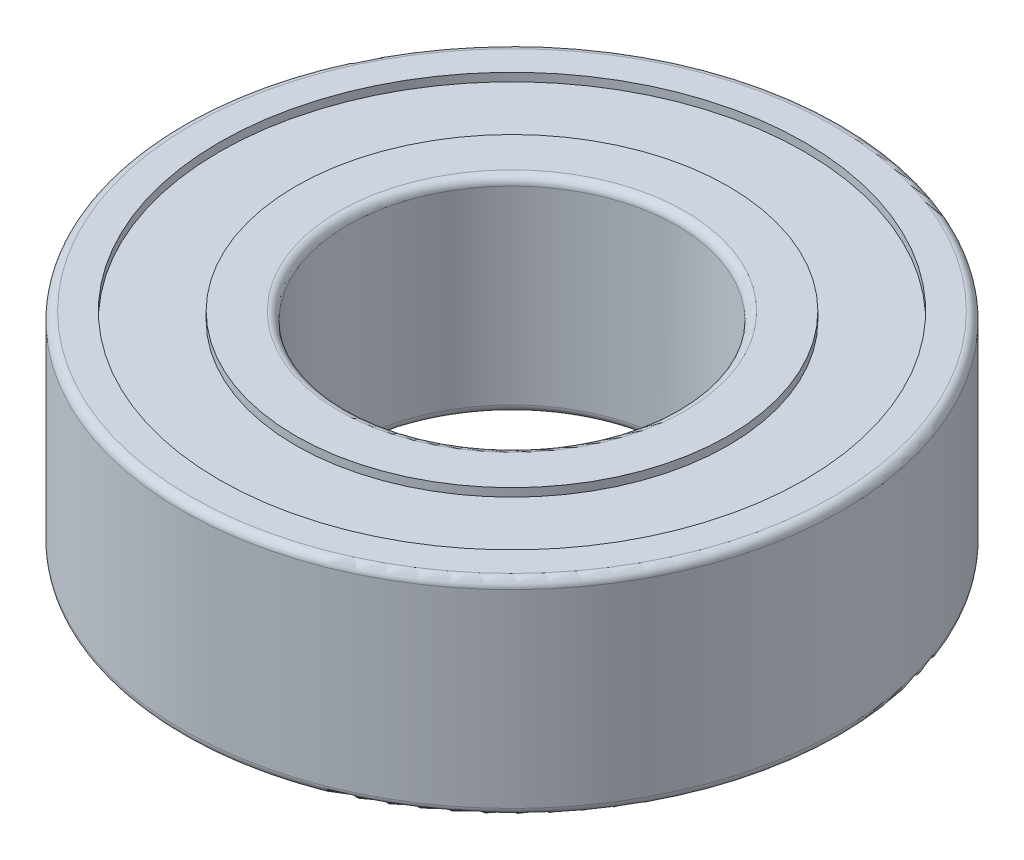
ISO-10303-21;
HEADER;
FILE_DESCRIPTION(('STEP AP214'),'2;1');
FILE_NAME('part.step','',(''),(''),'','','');
FILE_SCHEMA(('AUTOMOTIVE_DESIGN { 1 0 10303 214 1 1 1 1 }'));
ENDSEC;
DATA;
#1=APPLICATION_CONTEXT('core data for automotive mechanical design processes');
#2=APPLICATION_PROTOCOL_DEFINITION('international standard','automotive_design',2000,#1);
#3=PRODUCT_CONTEXT('',#1,'mechanical');
#4=PRODUCT('Part','Part','',(#3));
#5=PRODUCT_RELATED_PRODUCT_CATEGORY('part','',(#4));
#6=PRODUCT_DEFINITION_FORMATION('','',#4);
#7=PRODUCT_DEFINITION_CONTEXT('part definition',#1,'design');
#8=PRODUCT_DEFINITION('design','',#6,#7);
#9=PRODUCT_DEFINITION_SHAPE('','',#8);
#10=(LENGTH_UNIT() NAMED_UNIT(*) SI_UNIT(.MILLI.,.METRE.));
#11=(NAMED_UNIT(*) PLANE_ANGLE_UNIT() SI_UNIT($,.RADIAN.));
#12=(NAMED_UNIT(*) SI_UNIT($,.STERADIAN.) SOLID_ANGLE_UNIT());
#13=UNCERTAINTY_MEASURE_WITH_UNIT(LENGTH_MEASURE(1.E-05),#10,'distance_accuracy_value','');
#14=(GEOMETRIC_REPRESENTATION_CONTEXT(3) GLOBAL_UNCERTAINTY_ASSIGNED_CONTEXT((#13)) GLOBAL_UNIT_ASSIGNED_CONTEXT((#10,
#11,#12)) REPRESENTATION_CONTEXT('',''));
#15=CARTESIAN_POINT('',(0.,0.,0.));
#16=DIRECTION('',(0.,0.,1.));
#17=DIRECTION('',(1.,0.,0.));
#18=AXIS2_PLACEMENT_3D('',#15,#16,#17);
#19=CARTESIAN_POINT('',(0.,2.75,0.));
#20=DIRECTION('',(0.,-1.,0.));
#21=DIRECTION('',(0.,0.,-1.));
#22=AXIS2_PLACEMENT_3D('',#19,#20,#21);
#23=CYLINDRICAL_SURFACE('',#22,4.);
#24=CARTESIAN_POINT('',(0.,2.3,0.));
#25=DIRECTION('',(0.,-1.,0.));
#26=DIRECTION('',(0.999963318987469,0.,0.00856508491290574));
#27=AXIS2_PLACEMENT_3D('',#24,#25,#26);
#28=CIRCLE('',#27,4.);
#29=CARTESIAN_POINT('',(3.99985327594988,2.3,0.034260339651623));
#30=VERTEX_POINT('',#29);
#31=EDGE_CURVE('E258',#30,#30,#28,.T.);
#32=ORIENTED_EDGE('',*,*,#31,.F.);
#33=EDGE_LOOP('',(#32));
#34=FACE_BOUND('',#33,.T.);
#35=CARTESIAN_POINT('',(0.,-2.3,0.));
#36=DIRECTION('',(0.,-1.,0.));
#37=DIRECTION('',(-0.999919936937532,0.,-0.0126538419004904));
#38=AXIS2_PLACEMENT_3D('',#35,#36,#37);
#39=CIRCLE('',#38,4.);
#40=CARTESIAN_POINT('',(-3.99967974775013,-2.3,-0.0506153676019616));
#41=VERTEX_POINT('',#40);
#42=EDGE_CURVE('E74',#41,#41,#39,.F.);
#43=ORIENTED_EDGE('',*,*,#42,.F.);
#44=EDGE_LOOP('',(#43));
#45=FACE_BOUND('',#44,.T.);
#46=ADVANCED_FACE('F17',(#34,#45),#23,.F.);
#47=CARTESIAN_POINT('',(0.,2.3,0.));
#48=DIRECTION('',(0.,-1.,0.));
#49=DIRECTION('',(0.999963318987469,0.,0.00856508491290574));
#50=AXIS2_PLACEMENT_3D('',#47,#48,#49);
#51=TOROIDAL_SURFACE('',#50,4.2,0.2);
#52=CARTESIAN_POINT('',(-4.199999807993,2.49999999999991,0.));
#53=CARTESIAN_POINT('',(-4.19998514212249,2.49999999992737,0.0623584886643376));
#54=CARTESIAN_POINT('',(-4.19858069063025,2.49999999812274,0.124716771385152));
#55=CARTESIAN_POINT('',(-4.1928852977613,2.49999999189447,0.251851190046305));
#56=CARTESIAN_POINT('',(-4.18847892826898,2.49999998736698,0.316622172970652));
#57=CARTESIAN_POINT('',(-4.17643909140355,2.49999997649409,0.448424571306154));
#58=CARTESIAN_POINT('',(-4.16868589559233,2.49999997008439,0.515445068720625));
#59=CARTESIAN_POINT('',(-4.14960926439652,2.49999995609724,0.651555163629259));
#60=CARTESIAN_POINT('',(-4.13816219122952,2.49999994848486,0.720627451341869));
#61=CARTESIAN_POINT('',(-4.11135324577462,2.49999993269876,0.860613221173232));
#62=CARTESIAN_POINT('',(-4.09586420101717,2.49999992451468,0.931502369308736));
#63=CARTESIAN_POINT('',(-4.0606295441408,2.49999990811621,1.0748547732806));
#64=CARTESIAN_POINT('',(-4.04075369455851,2.49999989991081,1.14728603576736));
#65=CARTESIAN_POINT('',(-3.99640998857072,2.49999988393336,1.29341476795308));
#66=CARTESIAN_POINT('',(-3.97180935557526,2.49999987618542,1.36707198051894));
#67=CARTESIAN_POINT('',(-3.91769289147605,2.49999986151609,1.5152994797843));
#68=CARTESIAN_POINT('',(-3.88804239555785,2.49999985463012,1.5898205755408));
#69=CARTESIAN_POINT('',(-3.82351498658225,2.49999984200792,1.73938550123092));
#70=CARTESIAN_POINT('',(-3.78850207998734,2.49999983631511,1.81437087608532));
#71=CARTESIAN_POINT('',(-3.73228489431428,2.49999982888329,1.92604341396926));
#72=CARTESIAN_POINT('',(-3.71268842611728,2.49999982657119,1.96354855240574));
#73=CARTESIAN_POINT('',(-3.67206759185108,2.49999982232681,2.03851035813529));
#74=CARTESIAN_POINT('',(-3.65102618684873,2.49999982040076,2.07595781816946));
#75=CARTESIAN_POINT('',(-3.60748489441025,2.49999981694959,2.15073931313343));
#76=CARTESIAN_POINT('',(-3.58496801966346,2.49999981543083,2.18806345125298));
#77=CARTESIAN_POINT('',(-3.53844644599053,2.49999981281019,2.26253259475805));
#78=CARTESIAN_POINT('',(-3.51442482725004,2.49999981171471,2.29966703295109));
#79=CARTESIAN_POINT('',(-3.4648670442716,2.4999998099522,2.37368755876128));
#80=CARTESIAN_POINT('',(-3.43931406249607,2.49999980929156,2.41056238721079));
#81=CARTESIAN_POINT('',(-3.38666935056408,2.49999980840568,2.48399175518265));
#82=CARTESIAN_POINT('',(-3.35956093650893,2.49999980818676,2.52053433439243));
#83=CARTESIAN_POINT('',(-3.3037839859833,2.49999980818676,2.59322437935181));
#84=CARTESIAN_POINT('',(-3.27509893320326,2.49999980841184,2.6293591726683));
#85=CARTESIAN_POINT('',(-3.21615036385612,2.4999998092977,2.7011560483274));
#86=CARTESIAN_POINT('',(-3.18587053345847,2.49999980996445,2.73680473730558));
#87=CARTESIAN_POINT('',(-3.12371733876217,2.49999981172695,2.80754908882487));
#88=CARTESIAN_POINT('',(-3.09182789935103,2.49999981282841,2.84263062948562));
#89=CARTESIAN_POINT('',(-3.02644392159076,2.49999981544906,2.9121577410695));
#90=CARTESIAN_POINT('',(-2.99293358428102,2.49999981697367,2.94658845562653));
#91=CARTESIAN_POINT('',(-2.92429998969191,2.49999982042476,3.01472844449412));
#92=CARTESIAN_POINT('',(-2.88916124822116,2.49999982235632,3.04842212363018));
#93=CARTESIAN_POINT('',(-2.81726700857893,2.49999982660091,3.11500016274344));
#94=CARTESIAN_POINT('',(-2.78049638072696,2.49999982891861,3.14786818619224));
#95=CARTESIAN_POINT('',(-2.70533875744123,2.49999983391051,3.21270476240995));
#96=CARTESIAN_POINT('',(-2.6669370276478,2.49999983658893,3.24465623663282));
#97=CARTESIAN_POINT('',(-2.58852205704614,2.49999984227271,3.30756744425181));
#98=CARTESIAN_POINT('',(-2.54849451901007,2.49999984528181,3.33850935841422));
#99=CARTESIAN_POINT('',(-2.46683749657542,2.49999985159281,3.39930722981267));
#100=CARTESIAN_POINT('',(-2.42519419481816,2.49999985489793,3.42914463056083));
#101=CARTESIAN_POINT('',(-2.3403201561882,2.49999986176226,3.48763750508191));
#102=CARTESIAN_POINT('',(-2.29707612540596,2.49999986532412,3.51627369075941));
#103=CARTESIAN_POINT('',(-2.20902032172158,2.49999987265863,3.57226662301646));
#104=CARTESIAN_POINT('',(-2.16419582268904,2.49999987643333,3.599603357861));
#105=CARTESIAN_POINT('',(-2.07300418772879,2.49999988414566,3.65289856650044));
#106=CARTESIAN_POINT('',(-2.02662493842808,2.49999988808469,3.67883631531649));
#107=CARTESIAN_POINT('',(-1.93235454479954,2.49999989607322,3.72923367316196));
#108=CARTESIAN_POINT('',(-1.88445194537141,2.49999990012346,3.75367185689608));
#109=CARTESIAN_POINT('',(-1.78717144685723,2.49999990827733,3.80096942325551));
#110=CARTESIAN_POINT('',(-1.73778279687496,2.49999991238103,3.82380669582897));
#111=CARTESIAN_POINT('',(-1.63757285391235,2.49999992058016,3.86780129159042));
#112=CARTESIAN_POINT('',(-1.58674156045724,2.49999992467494,3.8889358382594));
#113=CARTESIAN_POINT('',(-1.48369524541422,2.49999993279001,3.92942366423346));
#114=CARTESIAN_POINT('',(-1.43147102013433,2.4999999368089,3.94875352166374));
#115=CARTESIAN_POINT('',(-1.32569419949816,2.49999994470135,3.9855308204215));
#116=CARTESIAN_POINT('',(-1.27213324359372,2.49999994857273,4.00295421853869));
#117=CARTESIAN_POINT('',(-1.16374493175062,2.49999995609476,4.03581797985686));
#118=CARTESIAN_POINT('',(-1.10891010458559,2.49999995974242,4.05123370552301));
#119=CARTESIAN_POINT('',(-0.998042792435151,2.49999996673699,4.07998241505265));
#120=CARTESIAN_POINT('',(-0.942003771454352,2.49999997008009,4.09329019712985));
#121=CARTESIAN_POINT('',(-0.828803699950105,2.49999997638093,4.11772462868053));
#122=CARTESIAN_POINT('',(-0.771637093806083,2.499999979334,4.12882554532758));
#123=CARTESIAN_POINT('',(-0.65626456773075,2.4999999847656,4.14874959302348));
#124=CARTESIAN_POINT('',(-0.598054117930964,2.49999998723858,4.15754649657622));
#125=CARTESIAN_POINT('',(-0.480683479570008,2.49999999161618,4.17276805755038));
#126=CARTESIAN_POINT('',(-0.421519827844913,2.49999999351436,4.17916603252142));
#127=CARTESIAN_POINT('',(-0.302340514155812,2.49999999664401,4.18949789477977));
#128=CARTESIAN_POINT('',(-0.242322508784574,2.49999999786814,4.19340468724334));
#129=CARTESIAN_POINT('',(-0.121535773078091,2.49999999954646,4.19866558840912));
#130=CARTESIAN_POINT('',(-0.060765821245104,2.49999999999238,4.1999922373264));
#131=CARTESIAN_POINT('',(0.0280316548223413,2.50000000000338,4.20000330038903));
#132=CARTESIAN_POINT('',(0.0560624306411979,2.49999999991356,4.19972608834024));
#133=CARTESIAN_POINT('',(0.112874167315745,2.49999999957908,4.19859514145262));
#134=CARTESIAN_POINT('',(0.14165482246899,2.49999999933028,4.19772595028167));
#135=CARTESIAN_POINT('',(0.230242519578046,2.49999999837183,4.19413797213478));
#136=CARTESIAN_POINT('',(0.290012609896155,2.49999999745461,4.19043542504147));
#137=CARTESIAN_POINT('',(0.412373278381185,2.49999999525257,4.18022444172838));
#138=CARTESIAN_POINT('',(0.474952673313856,2.49999999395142,4.17358285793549));
#139=CARTESIAN_POINT('',(0.602771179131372,2.4999999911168,4.15710479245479));
#140=CARTESIAN_POINT('',(0.667992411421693,2.49999998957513,4.14712922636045));
#141=CARTESIAN_POINT('',(0.800891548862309,2.49999998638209,4.1235853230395));
#142=CARTESIAN_POINT('',(0.868543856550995,2.49999998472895,4.10987237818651));
#143=CARTESIAN_POINT('',(1.00605976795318,2.49999998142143,4.07845071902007));
#144=CARTESIAN_POINT('',(1.07588920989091,2.4999999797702,4.06059237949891));
#145=CARTESIAN_POINT('',(1.21746747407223,2.49999997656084,4.02047589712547));
#146=CARTESIAN_POINT('',(1.28917269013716,2.49999997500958,3.99806370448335));
#147=CARTESIAN_POINT('',(1.43415863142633,2.49999997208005,3.94844070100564));
#148=CARTESIAN_POINT('',(1.50738534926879,2.49999997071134,3.9210721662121));
#149=CARTESIAN_POINT('',(1.65502442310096,2.49999996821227,3.86114392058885));
#150=CARTESIAN_POINT('',(1.72937179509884,2.49999996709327,3.82842348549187));
#151=CARTESIAN_POINT('',(1.8403990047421,2.49999996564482,3.77566672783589));
#152=CARTESIAN_POINT('',(1.8778288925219,2.49999996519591,3.75719205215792));
#153=CARTESIAN_POINT('',(1.95280026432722,2.49999996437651,3.71878738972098));
#154=CARTESIAN_POINT('',(1.99033132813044,2.4999999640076,3.6988370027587));
#155=CARTESIAN_POINT('',(2.06543707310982,2.49999996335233,3.65743876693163));
#156=CARTESIAN_POINT('',(2.10300048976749,2.49999996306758,3.63597049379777));
#157=CARTESIAN_POINT('',(2.17810132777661,2.4999999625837,3.59149552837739));
#158=CARTESIAN_POINT('',(2.21562665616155,2.49999996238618,3.56846841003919));
#159=CARTESIAN_POINT('',(2.29057736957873,2.49999996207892,3.52083731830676));
#160=CARTESIAN_POINT('',(2.32798980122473,2.49999996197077,3.49621296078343));
#161=CARTESIAN_POINT('',(2.40263716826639,2.49999996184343,3.44535146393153));
#162=CARTESIAN_POINT('',(2.43985827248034,2.4999999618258,3.41909402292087));
#163=CARTESIAN_POINT('',(2.5140416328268,2.49999996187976,3.36493331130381));
#164=CARTESIAN_POINT('',(2.55098916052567,2.49999996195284,3.33700986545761));
#165=CARTESIAN_POINT('',(2.62454029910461,2.49999996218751,3.27948725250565));
#166=CARTESIAN_POINT('',(2.66112826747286,2.49999996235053,3.24986808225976));
#167=CARTESIAN_POINT('',(2.73387153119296,2.49999996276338,3.18892759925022));
#168=CARTESIAN_POINT('',(2.77001025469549,2.49999996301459,3.15758650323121));
#169=CARTESIAN_POINT('',(2.84176265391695,2.49999996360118,3.09317953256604));
#170=CARTESIAN_POINT('',(2.87735881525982,2.49999996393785,3.06009414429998));
#171=CARTESIAN_POINT('',(2.94793018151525,2.49999996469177,2.99218006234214));
#172=CARTESIAN_POINT('',(2.9828869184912,2.49999996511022,2.95733217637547));
#173=CARTESIAN_POINT('',(3.05208010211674,2.49999996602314,2.88587901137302));
#174=CARTESIAN_POINT('',(3.08629711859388,2.4999999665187,2.84925491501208));
#175=CARTESIAN_POINT('',(3.15390823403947,2.49999996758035,2.77424001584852));
#176=CARTESIAN_POINT('',(3.18728193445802,2.49999996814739,2.73583082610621));
#177=CARTESIAN_POINT('',(3.25310065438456,2.49999996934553,2.65724153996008));
#178=CARTESIAN_POINT('',(3.28552430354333,2.49999996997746,2.61704354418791));
#179=CARTESIAN_POINT('',(3.34933420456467,2.49999997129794,2.53487790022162));
#180=CARTESIAN_POINT('',(3.3806981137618,2.49999997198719,2.49289289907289));
#181=CARTESIAN_POINT('',(3.4422770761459,2.49999997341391,2.407160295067));
#182=CARTESIAN_POINT('',(3.47246881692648,2.49999997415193,2.3633959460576));
#183=CARTESIAN_POINT('',(3.53158948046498,2.49999997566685,2.27411783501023));
#184=CARTESIAN_POINT('',(3.56049412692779,2.49999997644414,2.22858799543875));
#185=CARTESIAN_POINT('',(3.61692440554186,2.49999997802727,2.13579856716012));
#186=CARTESIAN_POINT('',(3.64442480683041,2.49999997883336,2.08852363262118));
#187=CARTESIAN_POINT('',(3.69792846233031,2.49999998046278,1.99227049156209));
#188=CARTESIAN_POINT('',(3.72390554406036,2.49999998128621,1.94327773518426));
#189=CARTESIAN_POINT('',(3.77424282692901,2.49999998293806,1.84362255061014));
#190=CARTESIAN_POINT('',(3.79857593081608,2.49999998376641,1.79294643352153));
#191=CARTESIAN_POINT('',(3.8455042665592,2.49999998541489,1.68996563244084));
#192=CARTESIAN_POINT('',(3.86807149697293,2.49999998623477,1.63764818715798));
#193=CARTESIAN_POINT('',(3.9113463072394,2.49999998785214,1.53143339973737));
#194=CARTESIAN_POINT('',(3.9320250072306,2.49999998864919,1.47752428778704));
#195=CARTESIAN_POINT('',(3.97073040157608,2.49999999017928,1.370043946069));
#196=CARTESIAN_POINT('',(3.98880378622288,2.49999999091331,1.31648952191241));
#197=CARTESIAN_POINT('',(4.02298838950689,2.49999999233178,1.20801670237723));
#198=CARTESIAN_POINT('',(4.03907206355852,2.49999999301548,1.15308962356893));
#199=CARTESIAN_POINT('',(4.06916732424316,2.49999999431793,1.04193787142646));
#200=CARTESIAN_POINT('',(4.08315068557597,2.49999999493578,0.985705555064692));
#201=CARTESIAN_POINT('',(4.10893636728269,2.4999999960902,0.87201716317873));
#202=CARTESIAN_POINT('',(4.12070981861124,2.49999999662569,0.81455453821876));
#203=CARTESIAN_POINT('',(4.14196811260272,2.49999999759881,0.698487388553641));
#204=CARTESIAN_POINT('',(4.15142348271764,2.49999999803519,0.63987746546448));
#205=CARTESIAN_POINT('',(4.16793979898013,2.49999999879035,0.521605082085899));
#206=CARTESIAN_POINT('',(4.17497071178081,2.49999999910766,0.461938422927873));
#207=CARTESIAN_POINT('',(4.18653516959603,2.49999999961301,0.341651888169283));
#208=CARTESIAN_POINT('',(4.19103817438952,2.49999999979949,0.281029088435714));
#209=CARTESIAN_POINT('',(4.19744501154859,2.4999999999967,0.158930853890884));
#210=CARTESIAN_POINT('',(4.19931782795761,2.50000000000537,0.0974537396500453));
#211=CARTESIAN_POINT('',(4.19986826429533,2.49999999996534,0.032932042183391));
#212=CARTESIAN_POINT('',(4.19989091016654,2.49999999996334,0.0298907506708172));
#213=CARTESIAN_POINT('',(4.19992968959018,2.499999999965,0.0238371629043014));
#214=CARTESIAN_POINT('',(4.19994588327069,2.49999999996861,0.0208248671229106));
#215=CARTESIAN_POINT('',(4.19998473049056,2.49999999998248,0.0118750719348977));
#216=CARTESIAN_POINT('',(4.19999838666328,2.49999999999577,0.00593752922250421));
#217=CARTESIAN_POINT('',(4.199999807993,2.49999999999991,0.));
#218=B_SPLINE_CURVE_WITH_KNOTS('',3,(#52,#53,#54,#55,#56,#57,#58,#59,#60,#61,#62,#63,#64,#65,
#66,#67,#68,#69,#70,#71,#72,#73,#74,#75,#76,#77,#78,#79,#80,#81,#82,#83,#84,#85,#86,#87,#88,#89,
#90,#91,#92,#93,#94,#95,#96,#97,#98,#99,#100,#101,#102,#103,#104,#105,#106,#107,#108,#109,#110,
#111,#112,#113,#114,#115,#116,#117,#118,#119,#120,#121,#122,#123,#124,#125,#126,#127,#128,#129,
#130,#131,#132,#133,#134,#135,#136,#137,#138,#139,#140,#141,#142,#143,#144,#145,#146,#147,#148,
#149,#150,#151,#152,#153,#154,#155,#156,#157,#158,#159,#160,#161,#162,#163,#164,#165,#166,#167,
#168,#169,#170,#171,#172,#173,#174,#175,#176,#177,#178,#179,#180,#181,#182,#183,#184,#185,#186,
#187,#188,#189,#190,#191,#192,#193,#194,#195,#196,#197,#198,#199,#200,#201,#202,#203,#204,#205,
#206,#207,#208,#209,#210,#211,#212,#213,#214,#215,#216,#217),.UNSPECIFIED.,.F.,.F.,(4,2,2,2,2,2,
2,2,2,2,2,2,2,2,2,2,2,2,2,2,2,2,2,2,2,2,2,2,2,2,2,2,2,2,2,2,2,2,2,2,2,2,2,2,2,2,2,2,2,2,2,2,2,2,
2,2,2,2,2,2,2,2,2,2,2,2,2,2,2,2,2,2,2,2,2,2,2,2,2,2,2,2,4),(0.,0.187060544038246,
0.381752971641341,0.58407715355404,0.794032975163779,1.01162033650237,1.23683915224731,
1.46968935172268,1.71017087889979,1.95828369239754,2.08521630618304,2.21405739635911,
2.34480698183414,2.47746508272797,2.61203172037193,2.74850691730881,2.88689069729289,
3.02718308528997,3.16938410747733,3.31349379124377,3.45951216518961,3.60743925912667,
3.75727510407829,3.90901973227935,4.06267317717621,4.21823547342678,4.37570665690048,
4.53508676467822,4.69637583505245,4.85957390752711,5.02468102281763,5.19169722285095,
5.3606225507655,5.53145705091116,5.70420076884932,5.8788537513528,6.05541604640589,
6.23388770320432,6.41426877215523,6.5965593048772,6.68065107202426,6.76702714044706,
6.94662189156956,7.13535213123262,7.33321762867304,7.54021813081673,7.75635336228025,
7.98162302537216,8.2160268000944,8.45956434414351,8.58477207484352,8.71226388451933,
8.84203975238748,8.97409965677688,9.10844357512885,9.2450714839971,9.38398335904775,
9.52517917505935,9.6686589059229,9.81442252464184,9.96247000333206,10.1128013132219,
10.2654164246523,10.4203153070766,10.5774979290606,10.7369642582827,10.8987142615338,
11.0627479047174,11.2290651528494,11.3976659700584,11.5685503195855,11.7417181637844,
11.9112380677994,12.0828905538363,12.2566755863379,12.4325931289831,12.6106431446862,
12.7908255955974,12.9731404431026,13.1575876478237,13.166711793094,13.1757488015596,
13.1935614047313),.UNSPECIFIED.);
#219=CARTESIAN_POINT('',(-4.1999998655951,2.49999999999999,0.));
#220=VERTEX_POINT('',#219);
#221=CARTESIAN_POINT('',(4.1999998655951,2.49999999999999,0.));
#222=VERTEX_POINT('',#221);
#223=EDGE_CURVE('E68',#220,#222,#218,.T.);
#224=ORIENTED_EDGE('',*,*,#223,.T.);
#225=CARTESIAN_POINT('',(0.,2.49999999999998,0.));
#226=DIRECTION('',(0.,1.,0.));
#227=DIRECTION('',(1.,0.,0.));
#228=AXIS2_PLACEMENT_3D('',#225,#226,#227);
#229=CIRCLE('',#228,4.1999999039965);
#230=EDGE_CURVE('E64',#222,#220,#229,.T.);
#231=ORIENTED_EDGE('',*,*,#230,.T.);
#232=EDGE_LOOP('',(#224,#231));
#233=FACE_BOUND('',#232,.T.);
#234=ORIENTED_EDGE('',*,*,#31,.T.);
#235=EDGE_LOOP('',(#234));
#236=FACE_BOUND('',#235,.T.);
#237=ADVANCED_FACE('F69',(#233,#236),#51,.T.);
#238=CARTESIAN_POINT('',(0.,-2.3,0.));
#239=DIRECTION('',(0.,-1.,0.));
#240=DIRECTION('',(-0.999919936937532,0.,-0.0126538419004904));
#241=AXIS2_PLACEMENT_3D('',#238,#239,#240);
#242=TOROIDAL_SURFACE('',#241,4.2,0.2);
#243=ORIENTED_EDGE('',*,*,#42,.T.);
#244=EDGE_LOOP('',(#243));
#245=FACE_BOUND('',#244,.T.);
#246=CARTESIAN_POINT('',(0.,-2.49999999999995,0.));
#247=DIRECTION('',(0.,-1.,0.));
#248=DIRECTION('',(1.,0.,0.));
#249=AXIS2_PLACEMENT_3D('',#246,#247,#248);
#250=CIRCLE('',#249,4.199999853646);
#251=CARTESIAN_POINT('',(-4.1999997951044,-2.49999999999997,0.));
#252=VERTEX_POINT('',#251);
#253=CARTESIAN_POINT('',(4.1999997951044,-2.49999999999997,0.));
#254=VERTEX_POINT('',#253);
#255=EDGE_CURVE('E235',#252,#254,#250,.F.);
#256=ORIENTED_EDGE('',*,*,#255,.F.);
#257=CARTESIAN_POINT('',(-4.199999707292,-2.49999999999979,0.));
#258=CARTESIAN_POINT('',(-4.19999765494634,-2.49999999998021,-0.00872374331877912));
#259=CARTESIAN_POINT('',(-4.19996921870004,-2.49999999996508,-0.0174474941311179));
#260=CARTESIAN_POINT('',(-4.19988665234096,-2.49999999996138,-0.0306334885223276));
#261=CARTESIAN_POINT('',(-4.19985185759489,-2.49999999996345,-0.0350958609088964));
#262=CARTESIAN_POINT('',(-4.1997679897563,-2.49999999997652,-0.0440875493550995));
#263=CARTESIAN_POINT('',(-4.19971870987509,-2.49999999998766,-0.0486168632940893));
#264=CARTESIAN_POINT('',(-4.19911821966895,-2.5000000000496,-0.096679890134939));
#265=CARTESIAN_POINT('',(-4.19789919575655,-2.49999999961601,-0.140207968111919));
#266=CARTESIAN_POINT('',(-4.19410687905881,-2.4999999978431,-0.227203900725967));
#267=CARTESIAN_POINT('',(-4.19153357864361,-2.49999999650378,-0.270671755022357));
#268=CARTESIAN_POINT('',(-4.18503657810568,-2.49999999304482,-0.357507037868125));
#269=CARTESIAN_POINT('',(-4.18111287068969,-2.49999999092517,-0.400874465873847));
#270=CARTESIAN_POINT('',(-4.17191846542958,-2.49999998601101,-0.487466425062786));
#271=CARTESIAN_POINT('',(-4.16664776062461,-2.4999999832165,-0.530690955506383));
#272=CARTESIAN_POINT('',(-4.15476454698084,-2.49999997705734,-0.616955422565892));
#273=CARTESIAN_POINT('',(-4.14815203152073,-2.49999997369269,-0.659995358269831));
#274=CARTESIAN_POINT('',(-4.13359155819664,-2.4999999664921,-0.745848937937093));
#275=CARTESIAN_POINT('',(-4.12564359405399,-2.49999996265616,-0.788662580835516));
#276=CARTESIAN_POINT('',(-4.10841990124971,-2.49999995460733,-0.874022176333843));
#277=CARTESIAN_POINT('',(-4.09914416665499,-2.49999995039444,-0.91656812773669));
#278=CARTESIAN_POINT('',(-4.0792739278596,-2.49999994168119,-1.00135105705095));
#279=CARTESIAN_POINT('',(-4.06867941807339,-2.49999993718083,-1.04358803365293));
#280=CARTESIAN_POINT('',(-4.04559219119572,-2.49999992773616,-1.12991704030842));
#281=CARTESIAN_POINT('',(-4.03302908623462,-2.49999992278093,-1.17399026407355));
#282=CARTESIAN_POINT('',(-4.00646701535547,-2.49999991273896,-1.26170197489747));
#283=CARTESIAN_POINT('',(-3.99246804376,-2.49999990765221,-1.30534046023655));
#284=CARTESIAN_POINT('',(-3.96304920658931,-2.49999989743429,-1.39213603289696));
#285=CARTESIAN_POINT('',(-3.94762933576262,-2.49999989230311,-1.43529311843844));
#286=CARTESIAN_POINT('',(-3.91538522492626,-2.49999988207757,-1.52107959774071));
#287=CARTESIAN_POINT('',(-3.89856098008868,-2.49999987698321,-1.56370898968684));
#288=CARTESIAN_POINT('',(-3.86352614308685,-2.49999986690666,-1.6483943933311));
#289=CARTESIAN_POINT('',(-3.84531554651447,-2.49999986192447,-1.69045040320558));
#290=CARTESIAN_POINT('',(-3.80752751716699,-2.49999985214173,-1.77394395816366));
#291=CARTESIAN_POINT('',(-3.78795008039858,-2.49999984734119,-1.81538150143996));
#292=CARTESIAN_POINT('',(-3.74744934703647,-2.49999983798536,-1.89759370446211));
#293=CARTESIAN_POINT('',(-3.72652604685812,-2.49999983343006,-1.93836836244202));
#294=CARTESIAN_POINT('',(-3.6833560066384,-2.49999982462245,-2.01921108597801));
#295=CARTESIAN_POINT('',(-3.66110926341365,-2.49999982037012,-2.05927914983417));
#296=CARTESIAN_POINT('',(-3.61531617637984,-2.49999981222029,-2.13866573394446));
#297=CARTESIAN_POINT('',(-3.59176982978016,-2.49999980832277,-2.17798425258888));
#298=CARTESIAN_POINT('',(-3.54340276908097,-2.49999980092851,-2.25582959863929));
#299=CARTESIAN_POINT('',(-3.51858205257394,-2.49999979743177,-2.29435642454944));
#300=CARTESIAN_POINT('',(-3.46769285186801,-2.49999979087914,-2.37057708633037));
#301=CARTESIAN_POINT('',(-3.44162436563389,-2.49999978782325,-2.40827092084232));
#302=CARTESIAN_POINT('',(-3.38826756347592,-2.49999978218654,-2.48278519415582));
#303=CARTESIAN_POINT('',(-3.36097924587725,-2.49999977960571,-2.51960563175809));
#304=CARTESIAN_POINT('',(-3.30521202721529,-2.49999977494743,-2.59233364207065));
#305=CARTESIAN_POINT('',(-3.2767331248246,-2.49999977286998,-2.62824121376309));
#306=CARTESIAN_POINT('',(-3.21861525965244,-2.49999976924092,-2.699105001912));
#307=CARTESIAN_POINT('',(-3.18897629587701,-2.4999997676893,-2.73406121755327));
#308=CARTESIAN_POINT('',(-3.12857007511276,-2.49999976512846,-2.80298482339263));
#309=CARTESIAN_POINT('',(-3.09780281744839,-2.49999976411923,-2.83695221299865));
#310=CARTESIAN_POINT('',(-3.03517298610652,-2.49999976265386,-2.90386175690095));
#311=CARTESIAN_POINT('',(-3.0033104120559,-2.49999976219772,-2.93680391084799));
#312=CARTESIAN_POINT('',(-2.93852409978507,-2.49999976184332,-3.00162767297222));
#313=CARTESIAN_POINT('',(-2.90560036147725,-2.49999976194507,-3.03350928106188));
#314=CARTESIAN_POINT('',(-2.83872701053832,-2.49999976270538,-3.09617777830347));
#315=CARTESIAN_POINT('',(-2.8047773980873,-2.49999976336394,-3.12696466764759));
#316=CARTESIAN_POINT('',(-2.73588868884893,-2.49999976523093,-3.18741072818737));
#317=CARTESIAN_POINT('',(-2.70094959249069,-2.49999976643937,-3.21706989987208));
#318=CARTESIAN_POINT('',(-2.63011936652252,-2.49999976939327,-3.27522873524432));
#319=CARTESIAN_POINT('',(-2.5942282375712,-2.49999977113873,-3.30372839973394));
#320=CARTESIAN_POINT('',(-2.52153241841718,-2.499999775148,-3.35953767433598));
#321=CARTESIAN_POINT('',(-2.48472772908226,-2.4999997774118,-3.38684728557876));
#322=CARTESIAN_POINT('',(-2.41024424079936,-2.49999978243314,-3.44024718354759));
#323=CARTESIAN_POINT('',(-2.37256544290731,-2.49999978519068,-3.4663374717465));
#324=CARTESIAN_POINT('',(-2.29637412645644,-2.49999979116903,-3.51727076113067));
#325=CARTESIAN_POINT('',(-2.25786160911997,-2.49999979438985,-3.54211376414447));
#326=CARTESIAN_POINT('',(-2.18004413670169,-2.4999998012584,-3.59052585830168));
#327=CARTESIAN_POINT('',(-2.14073918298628,-2.49999980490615,-3.61409495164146));
#328=CARTESIAN_POINT('',(-2.06137897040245,-2.49999981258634,-3.6599339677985));
#329=CARTESIAN_POINT('',(-2.02132371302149,-2.49999981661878,-3.68220389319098));
#330=CARTESIAN_POINT('',(-1.94050583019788,-2.49999982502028,-3.72542070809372));
#331=CARTESIAN_POINT('',(-1.89974320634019,-2.49999982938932,-3.74636760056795));
#332=CARTESIAN_POINT('',(-1.81755428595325,-2.49999983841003,-3.78691590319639));
#333=CARTESIAN_POINT('',(-1.77612799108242,-2.49999984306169,-3.80651731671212));
#334=CARTESIAN_POINT('',(-1.69265613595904,-2.49999985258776,-3.84435365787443));
#335=CARTESIAN_POINT('',(-1.65061057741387,-2.49999985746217,-3.8625885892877));
#336=CARTESIAN_POINT('',(-1.56594526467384,-2.49999986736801,-3.89767242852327));
#337=CARTESIAN_POINT('',(-1.52332551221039,-2.49999987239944,-3.91452134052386));
#338=CARTESIAN_POINT('',(-1.43755750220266,-2.49999988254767,-3.94681508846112));
#339=CARTESIAN_POINT('',(-1.39440924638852,-2.49999988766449,-3.9622599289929));
#340=CARTESIAN_POINT('',(-1.30763046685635,-2.49999989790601,-3.99172899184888));
#341=CARTESIAN_POINT('',(-1.26399994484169,-2.49999990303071,-4.00575321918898));
#342=CARTESIAN_POINT('',(-1.17630346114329,-2.49999991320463,-4.03236602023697));
#343=CARTESIAN_POINT('',(-1.13223750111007,-2.49999991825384,-4.0449545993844));
#344=CARTESIAN_POINT('',(-1.04261508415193,-2.49999992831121,-4.06897808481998));
#345=CARTESIAN_POINT('',(-0.997048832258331,-2.49999993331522,-4.08037646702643));
#346=CARTESIAN_POINT('',(-0.90555985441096,-2.49999994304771,-4.10163819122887));
#347=CARTESIAN_POINT('',(-0.859637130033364,-2.49999994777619,-4.11150154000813));
#348=CARTESIAN_POINT('',(-0.767486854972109,-2.49999995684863,-4.12968212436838));
#349=CARTESIAN_POINT('',(-0.721259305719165,-2.49999996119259,-4.13799936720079));
#350=CARTESIAN_POINT('',(-0.628551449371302,-2.49999996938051,-4.15307838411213));
#351=CARTESIAN_POINT('',(-0.582071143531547,-2.49999997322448,-4.15984016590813));
#352=CARTESIAN_POINT('',(-0.488910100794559,-2.49999998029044,-4.17180066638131));
#353=CARTESIAN_POINT('',(-0.44222936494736,-2.49999998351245,-4.17699939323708));
#354=CARTESIAN_POINT('',(-0.348720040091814,-2.49999998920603,-4.18582793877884));
#355=CARTESIAN_POINT('',(-0.301891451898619,-2.49999999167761,-4.18945776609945));
#356=CARTESIAN_POINT('',(-0.208139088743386,-2.49999999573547,-4.19514447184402));
#357=CARTESIAN_POINT('',(-0.161215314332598,-2.49999999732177,-4.19720135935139));
#358=CARTESIAN_POINT('',(-0.0673256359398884,-2.49999999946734,-4.1997397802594));
#359=CARTESIAN_POINT('',(-0.0203597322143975,-2.50000000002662,-4.20022132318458));
#360=CARTESIAN_POINT('',(0.0775690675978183,-2.49999999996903,-4.19958280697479));
#361=CARTESIAN_POINT('',(0.128531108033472,-2.49999999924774,-4.19832259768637));
#362=CARTESIAN_POINT('',(0.230113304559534,-2.49999999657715,-4.19395976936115));
#363=CARTESIAN_POINT('',(0.280733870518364,-2.49999999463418,-4.19086666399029));
#364=CARTESIAN_POINT('',(0.381568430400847,-2.49999998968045,-4.18287048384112));
#365=CARTESIAN_POINT('',(0.431783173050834,-2.49999998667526,-4.17797685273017));
#366=CARTESIAN_POINT('',(0.531743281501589,-2.49999997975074,-4.16641429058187));
#367=CARTESIAN_POINT('',(0.581489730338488,-2.49999997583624,-4.15975472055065));
#368=CARTESIAN_POINT('',(0.680452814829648,-2.49999996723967,-4.14469685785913));
#369=CARTESIAN_POINT('',(0.729670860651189,-2.49999996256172,-4.13630783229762));
#370=CARTESIAN_POINT('',(0.827518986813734,-2.49999995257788,-4.11782947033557));
#371=CARTESIAN_POINT('',(0.876150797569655,-2.49999994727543,-4.10774929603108));
#372=CARTESIAN_POINT('',(0.972770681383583,-2.49999993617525,-4.08592873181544));
#373=CARTESIAN_POINT('',(1.02076079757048,-2.49999993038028,-4.0741973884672));
#374=CARTESIAN_POINT('',(1.11604380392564,-2.49999991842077,-4.04911618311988));
#375=CARTESIAN_POINT('',(1.16333904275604,-2.49999991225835,-4.03577524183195));
#376=CARTESIAN_POINT('',(1.258373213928,-2.49999989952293,-4.007159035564));
#377=CARTESIAN_POINT('',(1.30610211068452,-2.49999989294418,-3.99185042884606));
#378=CARTESIAN_POINT('',(1.4007204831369,-2.49999987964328,-3.95962402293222));
#379=CARTESIAN_POINT('',(1.44761313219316,-2.49999987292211,-3.94271553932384));
#380=CARTESIAN_POINT('',(1.54050937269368,-2.49999985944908,-3.90733863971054));
#381=CARTESIAN_POINT('',(1.58651644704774,-2.4999998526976,-3.88887936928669));
#382=CARTESIAN_POINT('',(1.6775944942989,-2.49999983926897,-3.85045137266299));
#383=CARTESIAN_POINT('',(1.72266925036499,-2.49999983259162,-3.8304916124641));
#384=CARTESIAN_POINT('',(1.81183833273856,-2.49999981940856,-3.78911416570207));
#385=CARTESIAN_POINT('',(1.85593673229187,-2.49999981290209,-3.76770525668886));
#386=CARTESIAN_POINT('',(1.94311145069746,-2.4999998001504,-3.72348197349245));
#387=CARTESIAN_POINT('',(1.98619212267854,-2.49999979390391,-3.7006761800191));
#388=CARTESIAN_POINT('',(2.07129241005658,-2.49999978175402,-3.65371239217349));
#389=CARTESIAN_POINT('',(2.11331664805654,-2.49999977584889,-3.62956277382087));
#390=CARTESIAN_POINT('',(2.19626774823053,-2.49999976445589,-3.57996528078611));
#391=CARTESIAN_POINT('',(2.23719949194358,-2.49999975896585,-3.55452557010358));
#392=CARTESIAN_POINT('',(2.31793192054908,-2.49999974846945,-3.50240239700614));
#393=CARTESIAN_POINT('',(2.3577377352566,-2.49999974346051,-3.47572687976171));
#394=CARTESIAN_POINT('',(2.43618723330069,-2.49999973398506,-3.42118704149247));
#395=CARTESIAN_POINT('',(2.47483628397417,-2.49999972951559,-3.39333044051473));
#396=CARTESIAN_POINT('',(2.55094376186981,-2.49999972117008,-3.33648371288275));
#397=CARTESIAN_POINT('',(2.58840778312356,-2.49999971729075,-3.30750107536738));
#398=CARTESIAN_POINT('',(2.66211925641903,-2.49999971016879,-3.24845777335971));
#399=CARTESIAN_POINT('',(2.69837251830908,-2.49999970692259,-3.21840436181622));
#400=CARTESIAN_POINT('',(2.7696390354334,-2.49999970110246,-3.15727512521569));
#401=CARTESIAN_POINT('',(2.80465830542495,-2.4999996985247,-3.12620631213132));
#402=CARTESIAN_POINT('',(2.87343586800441,-2.49999969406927,-3.06310189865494));
#403=CARTESIAN_POINT('',(2.90720036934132,-2.49999969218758,-3.03107306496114));
#404=CARTESIAN_POINT('',(2.97344984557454,-2.4999996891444,-2.96610415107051));
#405=CARTESIAN_POINT('',(3.00594121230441,-2.49999968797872,-2.93317058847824));
#406=CARTESIAN_POINT('',(3.06962824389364,-2.49999968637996,-2.86644757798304));
#407=CARTESIAN_POINT('',(3.10083047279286,-2.49999968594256,-2.83266439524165));
#408=CARTESIAN_POINT('',(3.16192537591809,-2.49999968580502,-2.76429723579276));
#409=CARTESIAN_POINT('',(3.19182477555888,-2.49999968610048,-2.72971926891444));
#410=CARTESIAN_POINT('',(3.25030243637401,-2.49999968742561,-2.65981727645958));
#411=CARTESIAN_POINT('',(3.27888757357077,-2.49999968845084,-2.62449900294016));
#412=CARTESIAN_POINT('',(3.33472733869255,-2.49999969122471,-2.55317069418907));
#413=CARTESIAN_POINT('',(3.36198898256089,-2.49999969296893,-2.51716615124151));
#414=CARTESIAN_POINT('',(3.41517454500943,-2.49999969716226,-2.44451908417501));
#415=CARTESIAN_POINT('',(3.44110560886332,-2.49999969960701,-2.40788179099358));
#416=CARTESIAN_POINT('',(3.49162488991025,-2.49999970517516,-2.33402241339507));
#417=CARTESIAN_POINT('',(3.51622037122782,-2.4999997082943,-2.29680529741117));
#418=CARTESIAN_POINT('',(3.56406539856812,-2.49999971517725,-2.22183880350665));
#419=CARTESIAN_POINT('',(3.58732231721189,-2.49999971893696,-2.18409413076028));
#420=CARTESIAN_POINT('',(3.63248909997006,-2.49999972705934,-2.10812432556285));
#421=CARTESIAN_POINT('',(3.65440643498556,-2.49999973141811,-2.06990363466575));
#422=CARTESIAN_POINT('',(3.6968948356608,-2.49999974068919,-1.99303280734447));
#423=CARTESIAN_POINT('',(3.71747346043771,-2.49999974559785,-1.95438684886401));
#424=CARTESIAN_POINT('',(3.75728706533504,-2.49999975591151,-1.87671564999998));
#425=CARTESIAN_POINT('',(3.77652968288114,-2.4999997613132,-1.83769432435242));
#426=CARTESIAN_POINT('',(3.81367566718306,-2.49999977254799,-1.75932166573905));
#427=CARTESIAN_POINT('',(3.8315867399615,-2.49999977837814,-1.71997398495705));
#428=CARTESIAN_POINT('',(3.86607574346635,-2.49999979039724,-1.64099689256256));
#429=CARTESIAN_POINT('',(3.88266143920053,-2.49999979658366,-1.60137087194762));
#430=CARTESIAN_POINT('',(3.91450739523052,-2.49999980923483,-1.52188454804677));
#431=CARTESIAN_POINT('',(3.92977547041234,-2.49999981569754,-1.48202737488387));
#432=CARTESIAN_POINT('',(3.95899560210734,-2.49999982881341,-1.40212452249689));
#433=CARTESIAN_POINT('',(3.9729555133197,-2.49999983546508,-1.36208171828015));
#434=CARTESIAN_POINT('',(3.99956970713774,-2.49999984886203,-1.28185462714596));
#435=CARTESIAN_POINT('',(4.01223187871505,-2.49999985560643,-1.2416729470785));
#436=CARTESIAN_POINT('',(4.04815977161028,-2.49999987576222,-1.12137619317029));
#437=CARTESIAN_POINT('',(4.06965373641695,-2.49999988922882,-1.04072366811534));
#438=CARTESIAN_POINT('',(4.1075484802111,-2.49999991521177,-0.879359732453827));
#439=CARTESIAN_POINT('',(4.12401272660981,-2.49999992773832,-0.79866314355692));
#440=CARTESIAN_POINT('',(4.15198425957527,-2.49999995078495,-0.637525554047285));
#441=CARTESIAN_POINT('',(4.16355488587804,-2.49999996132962,-0.557095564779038));
#442=CARTESIAN_POINT('',(4.18188891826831,-2.49999997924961,-0.396794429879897));
#443=CARTESIAN_POINT('',(4.18871534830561,-2.49999998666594,-0.316930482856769));
#444=CARTESIAN_POINT('',(4.19773085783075,-2.49999999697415,-0.158042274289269));
#445=CARTESIAN_POINT('',(4.19998235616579,-2.49999999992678,-0.0790215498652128));
#446=CARTESIAN_POINT('',(4.199999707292,-2.49999999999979,0.));
#447=B_SPLINE_CURVE_WITH_KNOTS('',3,(#257,#258,#259,#260,#261,#262,#263,#264,#265,#266,#267,
#268,#269,#270,#271,#272,#273,#274,#275,#276,#277,#278,#279,#280,#281,#282,#283,#284,#285,#286,
#287,#288,#289,#290,#291,#292,#293,#294,#295,#296,#297,#298,#299,#300,#301,#302,#303,#304,#305,
#306,#307,#308,#309,#310,#311,#312,#313,#314,#315,#316,#317,#318,#319,#320,#321,#322,#323,#324,
#325,#326,#327,#328,#329,#330,#331,#332,#333,#334,#335,#336,#337,#338,#339,#340,#341,#342,#343,
#344,#345,#346,#347,#348,#349,#350,#351,#352,#353,#354,#355,#356,#357,#358,#359,#360,#361,#362,
#363,#364,#365,#366,#367,#368,#369,#370,#371,#372,#373,#374,#375,#376,#377,#378,#379,#380,#381,
#382,#383,#384,#385,#386,#387,#388,#389,#390,#391,#392,#393,#394,#395,#396,#397,#398,#399,#400,
#401,#402,#403,#404,#405,#406,#407,#408,#409,#410,#411,#412,#413,#414,#415,#416,#417,#418,#419,
#420,#421,#422,#423,#424,#425,#426,#427,#428,#429,#430,#431,#432,#433,#434,#435,#436,#437,#438,
#439,#440,#441,#442,#443,#444,#445,#446),.UNSPECIFIED.,.F.,.F.,(4,2,2,2,2,2,2,2,2,2,2,2,2,2,2,2,
2,2,2,2,2,2,2,2,2,2,2,2,2,2,2,2,2,2,2,2,2,2,2,2,2,2,2,2,2,2,2,2,2,2,2,2,2,2,2,2,2,2,2,2,2,2,2,2,
2,2,2,2,2,2,2,2,2,2,2,2,2,2,2,2,2,2,2,2,2,2,2,2,2,2,2,2,2,2,4),(0.,0.026171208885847,
0.0395587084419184,0.0531474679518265,0.18375842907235,0.314370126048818,0.444982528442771,
0.575595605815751,0.706209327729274,0.836823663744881,0.967438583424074,1.0980540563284,
1.23551573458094,1.37297795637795,1.51044068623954,1.64790388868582,1.78536752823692,
1.92283156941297,2.06029597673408,2.19776071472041,2.33522574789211,2.4726910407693,
2.61015655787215,2.74762226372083,2.88508812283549,3.0225540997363,3.16002015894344,
3.29748626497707,3.43495238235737,3.57241847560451,3.70988450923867,3.84735044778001,
3.9848162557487,4.12228189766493,4.25974733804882,4.39721254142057,4.5346774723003,
4.67214209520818,4.80960637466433,4.9470702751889,5.08453376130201,5.22199679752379,
5.35945934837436,5.49692137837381,5.6378056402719,5.77868927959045,5.9195722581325,
6.06045453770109,6.20133608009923,6.34221684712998,6.48309680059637,6.62397590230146,
6.77687448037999,6.92898630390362,7.0803114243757,7.23084989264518,7.38060175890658,
7.52956707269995,7.67774588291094,7.82513823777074,7.97547756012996,8.12498985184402,
8.27367516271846,8.42153354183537,8.5685650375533,8.71476969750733,8.86014756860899,
9.00469869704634,9.14842312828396,9.29132090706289,9.4333920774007,9.57463668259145,
9.71505476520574,9.85464636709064,9.99341152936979,10.1313502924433,10.2684626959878,
10.4047487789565,10.5402085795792,10.674842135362,10.8086494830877,10.9416306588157,
11.0737856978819,11.2051146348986,11.3356175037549,11.4652943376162,11.5941451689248,
11.7221700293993,11.8493689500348,11.9757419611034,12.2259826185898,12.4729210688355,
12.7165574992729,12.956892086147,13.1939249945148),.UNSPECIFIED.);
#448=EDGE_CURVE('E80',#254,#252,#447,.F.);
#449=ORIENTED_EDGE('',*,*,#448,.F.);
#450=EDGE_LOOP('',(#256,#449));
#451=FACE_BOUND('',#450,.T.);
#452=ADVANCED_FACE('F101',(#245,#451),#242,.T.);
#453=CARTESIAN_POINT('',(0.,2.5,0.));
#454=DIRECTION('',(0.,-1.,0.));
#455=DIRECTION('',(0.,0.,-1.));
#456=AXIS2_PLACEMENT_3D('',#453,#454,#455);
#457=PLANE('',#456);
#458=ORIENTED_EDGE('',*,*,#223,.F.);
#459=ORIENTED_EDGE('',*,*,#230,.F.);
#460=EDGE_LOOP('',(#458,#459));
#461=FACE_BOUND('',#460,.T.);
#462=CARTESIAN_POINT('',(0.,2.5,0.));
#463=DIRECTION('',(0.,1.,0.));
#464=DIRECTION('',(0.,0.,1.));
#465=AXIS2_PLACEMENT_3D('',#462,#463,#464);
#466=CIRCLE('',#465,5.25);
#467=CARTESIAN_POINT('',(0.,2.5,5.25));
#468=VERTEX_POINT('',#467);
#469=EDGE_CURVE('E245',#468,#468,#466,.F.);
#470=ORIENTED_EDGE('',*,*,#469,.F.);
#471=EDGE_LOOP('',(#470));
#472=FACE_BOUND('',#471,.T.);
#473=ADVANCED_FACE('F77',(#461,#472),#457,.F.);
#474=CARTESIAN_POINT('',(0.,-2.5,0.));
#475=DIRECTION('',(0.,-1.,0.));
#476=DIRECTION('',(0.,0.,-1.));
#477=AXIS2_PLACEMENT_3D('',#474,#475,#476);
#478=PLANE('',#477);
#479=ORIENTED_EDGE('',*,*,#448,.T.);
#480=ORIENTED_EDGE('',*,*,#255,.T.);
#481=EDGE_LOOP('',(#479,#480));
#482=FACE_BOUND('',#481,.T.);
#483=CARTESIAN_POINT('',(0.,-2.5,0.));
#484=DIRECTION('',(0.,1.,0.));
#485=DIRECTION('',(0.,0.,1.));
#486=AXIS2_PLACEMENT_3D('',#483,#484,#485);
#487=CIRCLE('',#486,5.25);
#488=CARTESIAN_POINT('',(0.,-2.5,5.25));
#489=VERTEX_POINT('',#488);
#490=EDGE_CURVE('E251',#489,#489,#487,.T.);
#491=ORIENTED_EDGE('',*,*,#490,.F.);
#492=EDGE_LOOP('',(#491));
#493=FACE_BOUND('',#492,.T.);
#494=ADVANCED_FACE('F100',(#482,#493),#478,.T.);
#495=CARTESIAN_POINT('',(0.,-2.75,0.));
#496=DIRECTION('',(0.,1.,0.));
#497=DIRECTION('',(0.,0.,1.));
#498=AXIS2_PLACEMENT_3D('',#495,#496,#497);
#499=CYLINDRICAL_SURFACE('',#498,5.25);
#500=CARTESIAN_POINT('',(0.,2.3,0.));
#501=DIRECTION('',(0.,1.,0.));
#502=DIRECTION('',(0.,0.,1.));
#503=AXIS2_PLACEMENT_3D('',#500,#501,#502);
#504=CIRCLE('',#503,5.25);
#505=CARTESIAN_POINT('',(0.,2.3,5.25));
#506=VERTEX_POINT('',#505);
#507=EDGE_CURVE('E273',#506,#506,#504,.F.);
#508=ORIENTED_EDGE('',*,*,#507,.F.);
#509=EDGE_LOOP('',(#508));
#510=FACE_BOUND('',#509,.T.);
#511=ORIENTED_EDGE('',*,*,#469,.T.);
#512=EDGE_LOOP('',(#511));
#513=FACE_BOUND('',#512,.T.);
#514=ADVANCED_FACE('F377',(#510,#513),#499,.T.);
#515=CARTESIAN_POINT('',(0.,-2.75,0.));
#516=DIRECTION('',(0.,1.,0.));
#517=DIRECTION('',(0.,0.,1.));
#518=AXIS2_PLACEMENT_3D('',#515,#516,#517);
#519=CYLINDRICAL_SURFACE('',#518,5.25);
#520=CARTESIAN_POINT('',(0.,-2.3,0.));
#521=DIRECTION('',(0.,1.,0.));
#522=DIRECTION('',(0.,0.,1.));
#523=AXIS2_PLACEMENT_3D('',#520,#521,#522);
#524=CIRCLE('',#523,5.25);
#525=CARTESIAN_POINT('',(0.,-2.3,5.25));
#526=VERTEX_POINT('',#525);
#527=EDGE_CURVE('E268',#526,#526,#524,.F.);
#528=ORIENTED_EDGE('',*,*,#527,.T.);
#529=EDGE_LOOP('',(#528));
#530=FACE_BOUND('',#529,.T.);
#531=ORIENTED_EDGE('',*,*,#490,.T.);
#532=EDGE_LOOP('',(#531));
#533=FACE_BOUND('',#532,.T.);
#534=ADVANCED_FACE('F369',(#530,#533),#519,.T.);
#535=CARTESIAN_POINT('',(0.,2.3,0.));
#536=DIRECTION('',(0.,1.,0.));
#537=DIRECTION('',(0.,0.,1.));
#538=AXIS2_PLACEMENT_3D('',#535,#536,#537);
#539=PLANE('',#538);
#540=ORIENTED_EDGE('',*,*,#507,.T.);
#541=EDGE_LOOP('',(#540));
#542=FACE_BOUND('',#541,.T.);
#543=CARTESIAN_POINT('',(0.,2.3,0.));
#544=DIRECTION('',(0.,1.,0.));
#545=DIRECTION('',(0.,0.,1.));
#546=AXIS2_PLACEMENT_3D('',#543,#544,#545);
#547=CIRCLE('',#546,7.1);
#548=CARTESIAN_POINT('',(0.,2.3,7.1));
#549=VERTEX_POINT('',#548);
#550=EDGE_CURVE('E264',#549,#549,#547,.T.);
#551=ORIENTED_EDGE('',*,*,#550,.T.);
#552=EDGE_LOOP('',(#551));
#553=FACE_BOUND('',#552,.T.);
#554=ADVANCED_FACE('F361',(#542,#553),#539,.T.);
#555=CARTESIAN_POINT('',(0.,-2.3,0.));
#556=DIRECTION('',(0.,1.,0.));
#557=DIRECTION('',(0.,0.,1.));
#558=AXIS2_PLACEMENT_3D('',#555,#556,#557);
#559=PLANE('',#558);
#560=ORIENTED_EDGE('',*,*,#527,.F.);
#561=EDGE_LOOP('',(#560));
#562=FACE_BOUND('',#561,.T.);
#563=CARTESIAN_POINT('',(0.,-2.3,0.));
#564=DIRECTION('',(0.,1.,0.));
#565=DIRECTION('',(0.,0.,1.));
#566=AXIS2_PLACEMENT_3D('',#563,#564,#565);
#567=CIRCLE('',#566,7.1);
#568=CARTESIAN_POINT('',(0.,-2.3,7.1));
#569=VERTEX_POINT('',#568);
#570=EDGE_CURVE('E267',#569,#569,#567,.F.);
#571=ORIENTED_EDGE('',*,*,#570,.T.);
#572=EDGE_LOOP('',(#571));
#573=FACE_BOUND('',#572,.T.);
#574=ADVANCED_FACE('F353',(#562,#573),#559,.F.);
#575=CARTESIAN_POINT('',(0.,-2.75,0.));
#576=DIRECTION('',(0.,1.,0.));
#577=DIRECTION('',(0.,0.,1.));
#578=AXIS2_PLACEMENT_3D('',#575,#576,#577);
#579=CYLINDRICAL_SURFACE('',#578,7.1);
#580=ORIENTED_EDGE('',*,*,#550,.F.);
#581=EDGE_LOOP('',(#580));
#582=FACE_BOUND('',#581,.T.);
#583=CARTESIAN_POINT('',(0.,2.5,0.));
#584=DIRECTION('',(0.,1.,0.));
#585=DIRECTION('',(0.,0.,1.));
#586=AXIS2_PLACEMENT_3D('',#583,#584,#585);
#587=CIRCLE('',#586,7.1);
#588=CARTESIAN_POINT('',(0.,2.5,7.1));
#589=VERTEX_POINT('',#588);
#590=EDGE_CURVE('E261',#589,#589,#587,.T.);
#591=ORIENTED_EDGE('',*,*,#590,.T.);
#592=EDGE_LOOP('',(#591));
#593=FACE_BOUND('',#592,.T.);
#594=ADVANCED_FACE('F346',(#582,#593),#579,.F.);
#595=CARTESIAN_POINT('',(0.,-2.75,0.));
#596=DIRECTION('',(0.,1.,0.));
#597=DIRECTION('',(0.,0.,1.));
#598=AXIS2_PLACEMENT_3D('',#595,#596,#597);
#599=CYLINDRICAL_SURFACE('',#598,7.1);
#600=ORIENTED_EDGE('',*,*,#570,.F.);
#601=EDGE_LOOP('',(#600));
#602=FACE_BOUND('',#601,.T.);
#603=CARTESIAN_POINT('',(0.,-2.5,0.));
#604=DIRECTION('',(0.,1.,0.));
#605=DIRECTION('',(0.,0.,1.));
#606=AXIS2_PLACEMENT_3D('',#603,#604,#605);
#607=CIRCLE('',#606,7.1);
#608=CARTESIAN_POINT('',(0.,-2.5,7.1));
#609=VERTEX_POINT('',#608);
#610=EDGE_CURVE('E262',#609,#609,#607,.T.);
#611=ORIENTED_EDGE('',*,*,#610,.F.);
#612=EDGE_LOOP('',(#611));
#613=FACE_BOUND('',#612,.T.);
#614=ADVANCED_FACE('F339',(#602,#613),#599,.F.);
#615=CARTESIAN_POINT('',(0.,2.5,0.));
#616=DIRECTION('',(0.,-1.,0.));
#617=DIRECTION('',(0.,0.,-1.));
#618=AXIS2_PLACEMENT_3D('',#615,#616,#617);
#619=PLANE('',#618);
#620=ORIENTED_EDGE('',*,*,#590,.F.);
#621=EDGE_LOOP('',(#620));
#622=FACE_BOUND('',#621,.T.);
#623=CARTESIAN_POINT('',(0.,2.49999999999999,0.));
#624=DIRECTION('',(0.,-1.,0.));
#625=DIRECTION('',(-1.,0.,0.));
#626=AXIS2_PLACEMENT_3D('',#623,#624,#625);
#627=CIRCLE('',#626,7.7999999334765);
#628=CARTESIAN_POINT('',(-7.7999998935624,2.49999999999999,0.));
#629=VERTEX_POINT('',#628);
#630=CARTESIAN_POINT('',(7.7999998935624,2.49999999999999,0.));
#631=VERTEX_POINT('',#630);
#632=EDGE_CURVE('E192',#629,#631,#627,.T.);
#633=ORIENTED_EDGE('',*,*,#632,.F.);
#634=CARTESIAN_POINT('',(0.,2.49999999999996,0.));
#635=DIRECTION('',(0.,-1.,0.));
#636=DIRECTION('',(1.,0.,0.));
#637=AXIS2_PLACEMENT_3D('',#634,#635,#636);
#638=CIRCLE('',#637,7.799999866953);
#639=EDGE_CURVE('E202',#631,#629,#638,.T.);
#640=ORIENTED_EDGE('',*,*,#639,.F.);
#641=EDGE_LOOP('',(#633,#640));
#642=FACE_BOUND('',#641,.T.);
#643=ADVANCED_FACE('F166',(#622,#642),#619,.F.);
#644=CARTESIAN_POINT('',(0.,-2.5,0.));
#645=DIRECTION('',(0.,-1.,0.));
#646=DIRECTION('',(0.,0.,-1.));
#647=AXIS2_PLACEMENT_3D('',#644,#645,#646);
#648=PLANE('',#647);
#649=ORIENTED_EDGE('',*,*,#610,.T.);
#650=EDGE_LOOP('',(#649));
#651=FACE_BOUND('',#650,.T.);
#652=CARTESIAN_POINT('',(0.,-2.49999999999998,0.));
#653=DIRECTION('',(0.,1.,0.));
#654=DIRECTION('',(-1.,0.,0.));
#655=AXIS2_PLACEMENT_3D('',#652,#653,#654);
#656=CIRCLE('',#655,7.799999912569);
#657=CARTESIAN_POINT('',(7.7999999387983,-2.5,0.));
#658=VERTEX_POINT('',#657);
#659=CARTESIAN_POINT('',(-7.7999999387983,-2.5,0.));
#660=VERTEX_POINT('',#659);
#661=EDGE_CURVE('E40',#658,#660,#656,.F.);
#662=ORIENTED_EDGE('',*,*,#661,.T.);
#663=CARTESIAN_POINT('',(0.,-2.5,0.));
#664=DIRECTION('',(0.,1.,0.));
#665=DIRECTION('',(1.,0.,0.));
#666=AXIS2_PLACEMENT_3D('',#663,#664,#665);
#667=CIRCLE('',#666,7.7999999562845);
#668=EDGE_CURVE('E179',#658,#660,#667,.T.);
#669=ORIENTED_EDGE('',*,*,#668,.F.);
#670=EDGE_LOOP('',(#662,#669));
#671=FACE_BOUND('',#670,.T.);
#672=ADVANCED_FACE('F157',(#651,#671),#648,.T.);
#673=CARTESIAN_POINT('',(0.,2.3,0.));
#674=DIRECTION('',(0.,-1.,0.));
#675=DIRECTION('',(0.999979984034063,0.,0.00632704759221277));
#676=AXIS2_PLACEMENT_3D('',#673,#674,#675);
#677=TOROIDAL_SURFACE('',#676,7.8,0.2);
#678=CARTESIAN_POINT('',(0.,2.3,0.));
#679=DIRECTION('',(0.,-1.,0.));
#680=DIRECTION('',(0.,0.,-1.));
#681=AXIS2_PLACEMENT_3D('',#678,#679,#680);
#682=CIRCLE('',#681,8.);
#683=CARTESIAN_POINT('',(0.,2.3,-8.));
#684=VERTEX_POINT('',#683);
#685=EDGE_CURVE('E28',#684,#684,#682,.T.);
#686=ORIENTED_EDGE('',*,*,#685,.F.);
#687=EDGE_LOOP('',(#686));
#688=FACE_BOUND('',#687,.T.);
#689=ORIENTED_EDGE('',*,*,#632,.T.);
#690=ORIENTED_EDGE('',*,*,#639,.T.);
#691=EDGE_LOOP('',(#689,#690));
#692=FACE_BOUND('',#691,.T.);
#693=ADVANCED_FACE('F143',(#688,#692),#677,.T.);
#694=CARTESIAN_POINT('',(0.,-2.3,0.));
#695=DIRECTION('',(0.,-1.,0.));
#696=DIRECTION('',(0.99999082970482,0.,0.00428258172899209));
#697=AXIS2_PLACEMENT_3D('',#694,#695,#696);
#698=TOROIDAL_SURFACE('',#697,7.8,0.2);
#699=ORIENTED_EDGE('',*,*,#668,.T.);
#700=ORIENTED_EDGE('',*,*,#661,.F.);
#701=EDGE_LOOP('',(#699,#700));
#702=FACE_BOUND('',#701,.T.);
#703=CARTESIAN_POINT('',(0.,-2.3,0.));
#704=DIRECTION('',(0.,-1.,0.));
#705=DIRECTION('',(0.,0.,-1.));
#706=AXIS2_PLACEMENT_3D('',#703,#704,#705);
#707=CIRCLE('',#706,8.);
#708=CARTESIAN_POINT('',(0.,-2.3,-8.));
#709=VERTEX_POINT('',#708);
#710=EDGE_CURVE('E11',#709,#709,#707,.F.);
#711=ORIENTED_EDGE('',*,*,#710,.F.);
#712=EDGE_LOOP('',(#711));
#713=FACE_BOUND('',#712,.T.);
#714=ADVANCED_FACE('F131',(#702,#713),#698,.T.);
#715=CARTESIAN_POINT('',(0.,2.75,0.));
#716=DIRECTION('',(0.,-1.,0.));
#717=DIRECTION('',(0.,0.,-1.));
#718=AXIS2_PLACEMENT_3D('',#715,#716,#717);
#719=CYLINDRICAL_SURFACE('',#718,8.);
#720=ORIENTED_EDGE('',*,*,#685,.T.);
#721=EDGE_LOOP('',(#720));
#722=FACE_BOUND('',#721,.T.);
#723=ORIENTED_EDGE('',*,*,#710,.T.);
#724=EDGE_LOOP('',(#723));
#725=FACE_BOUND('',#724,.T.);
#726=ADVANCED_FACE('F142',(#722,#725),#719,.T.);
#727=CLOSED_SHELL('',(#46,#237,#452,#473,#494,#514,#534,#554,#574,#594,#614,#643,#672,#693,#714,#726));
#728=MANIFOLD_SOLID_BREP('B1',#727);
#729=ADVANCED_BREP_SHAPE_REPRESENTATION('',(#18,#728),#14);
#730=SHAPE_DEFINITION_REPRESENTATION(#9,#729);
ENDSEC;
END-ISO-10303-21;
